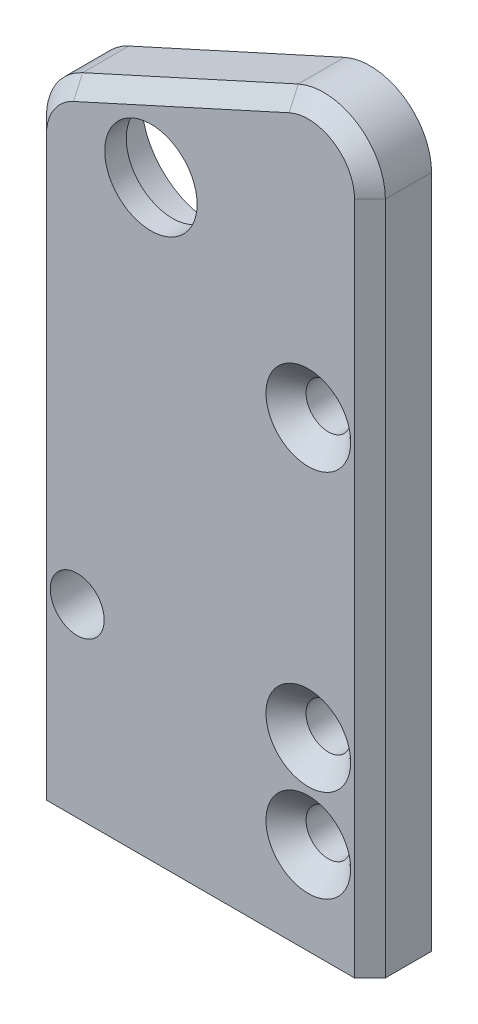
ISO-10303-21;
HEADER;
FILE_DESCRIPTION(('STEP AP214'),'2;1');
FILE_NAME('part.step','',(''),(''),'','','');
FILE_SCHEMA(('AUTOMOTIVE_DESIGN { 1 0 10303 214 1 1 1 1 }'));
ENDSEC;
DATA;
#1=APPLICATION_CONTEXT('core data for automotive mechanical design processes');
#2=APPLICATION_PROTOCOL_DEFINITION('international standard','automotive_design',2000,#1);
#3=PRODUCT_CONTEXT('',#1,'mechanical');
#4=PRODUCT('Part','Part','',(#3));
#5=PRODUCT_RELATED_PRODUCT_CATEGORY('part','',(#4));
#6=PRODUCT_DEFINITION_FORMATION('','',#4);
#7=PRODUCT_DEFINITION_CONTEXT('part definition',#1,'design');
#8=PRODUCT_DEFINITION('design','',#6,#7);
#9=PRODUCT_DEFINITION_SHAPE('','',#8);
#10=(LENGTH_UNIT() NAMED_UNIT(*) SI_UNIT(.MILLI.,.METRE.));
#11=(NAMED_UNIT(*) PLANE_ANGLE_UNIT() SI_UNIT($,.RADIAN.));
#12=(NAMED_UNIT(*) SI_UNIT($,.STERADIAN.) SOLID_ANGLE_UNIT());
#13=UNCERTAINTY_MEASURE_WITH_UNIT(LENGTH_MEASURE(1.E-05),#10,'distance_accuracy_value','');
#14=(GEOMETRIC_REPRESENTATION_CONTEXT(3) GLOBAL_UNCERTAINTY_ASSIGNED_CONTEXT((#13)) GLOBAL_UNIT_ASSIGNED_CONTEXT((#10,
#11,#12)) REPRESENTATION_CONTEXT('',''));
#15=CARTESIAN_POINT('',(0.,0.,0.));
#16=DIRECTION('',(0.,0.,1.));
#17=DIRECTION('',(1.,0.,0.));
#18=AXIS2_PLACEMENT_3D('',#15,#16,#17);
#19=CARTESIAN_POINT('',(7.78086952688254,38.3937133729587,4.));
#20=DIRECTION('',(0.,0.,1.));
#21=DIRECTION('',(1.,0.,0.));
#22=AXIS2_PLACEMENT_3D('',#19,#20,#21);
#23=CYLINDRICAL_SURFACE('',#22,3.);
#24=CARTESIAN_POINT('',(7.78086952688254,38.3937133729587,4.));
#25=DIRECTION('',(0.,0.,1.));
#26=DIRECTION('',(1.,0.,0.));
#27=AXIS2_PLACEMENT_3D('',#24,#25,#26);
#28=CIRCLE('',#27,3.);
#29=CARTESIAN_POINT('',(10.7808695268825,38.3937133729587,4.));
#30=VERTEX_POINT('',#29);
#31=EDGE_CURVE('E156',#30,#30,#28,.T.);
#32=ORIENTED_EDGE('',*,*,#31,.T.);
#33=EDGE_LOOP('',(#32));
#34=FACE_BOUND('',#33,.T.);
#35=CARTESIAN_POINT('',(7.78086952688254,38.3937133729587,2.6));
#36=DIRECTION('',(0.,0.,-1.));
#37=DIRECTION('',(-1.,0.,0.));
#38=AXIS2_PLACEMENT_3D('',#35,#36,#37);
#39=CIRCLE('',#38,3.);
#40=CARTESIAN_POINT('',(4.78086952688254,38.3937133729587,2.6));
#41=VERTEX_POINT('',#40);
#42=EDGE_CURVE('E43',#41,#41,#39,.F.);
#43=ORIENTED_EDGE('',*,*,#42,.F.);
#44=EDGE_LOOP('',(#43));
#45=FACE_BOUND('',#44,.T.);
#46=ADVANCED_FACE('F38',(#34,#45),#23,.F.);
#47=CARTESIAN_POINT('',(0.,40.,4.));
#48=DIRECTION('',(1.,0.,0.));
#49=DIRECTION('',(0.,1.,0.));
#50=AXIS2_PLACEMENT_3D('',#47,#48,#49);
#51=PLANE('',#50);
#52=DIRECTION('',(0.,0.,-1.));
#53=VECTOR('',#52,1.);
#54=CARTESIAN_POINT('',(0.,0.,4.));
#55=LINE('',#54,#53);
#56=CARTESIAN_POINT('',(0.,0.,3.));
#57=VERTEX_POINT('',#56);
#58=CARTESIAN_POINT('',(0.,0.,0.));
#59=VERTEX_POINT('',#58);
#60=EDGE_CURVE('E178',#57,#59,#55,.T.);
#61=ORIENTED_EDGE('',*,*,#60,.F.);
#62=DIRECTION('',(0.,1.,0.));
#63=VECTOR('',#62,1.);
#64=CARTESIAN_POINT('',(0.,37.4243469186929,3.));
#65=LINE('',#64,#63);
#66=CARTESIAN_POINT('',(0.,37.4243469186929,3.));
#67=VERTEX_POINT('',#66);
#68=EDGE_CURVE('E11',#57,#67,#65,.T.);
#69=ORIENTED_EDGE('',*,*,#68,.T.);
#70=DIRECTION('',(0.,0.,-1.));
#71=VECTOR('',#70,1.);
#72=CARTESIAN_POINT('',(0.,37.4243469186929,4.));
#73=LINE('',#72,#71);
#74=CARTESIAN_POINT('',(0.,37.4243469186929,0.));
#75=VERTEX_POINT('',#74);
#76=EDGE_CURVE('E180',#67,#75,#73,.T.);
#77=ORIENTED_EDGE('',*,*,#76,.T.);
#78=DIRECTION('',(0.,-1.,0.));
#79=VECTOR('',#78,1.);
#80=CARTESIAN_POINT('',(0.,40.,0.));
#81=LINE('',#80,#79);
#82=EDGE_CURVE('E165',#75,#59,#81,.T.);
#83=ORIENTED_EDGE('',*,*,#82,.T.);
#84=EDGE_LOOP('',(#61,#69,#77,#83));
#85=FACE_BOUND('',#84,.T.);
#86=ADVANCED_FACE('F268',(#85),#51,.F.);
#87=CARTESIAN_POINT('',(0.,0.,4.));
#88=DIRECTION('',(0.,1.,0.));
#89=DIRECTION('',(0.,0.,1.));
#90=AXIS2_PLACEMENT_3D('',#87,#88,#89);
#91=PLANE('',#90);
#92=CARTESIAN_POINT('',(4.,0.,2.));
#93=DIRECTION('',(0.,-1.,0.));
#94=DIRECTION('',(0.,0.,-1.));
#95=AXIS2_PLACEMENT_3D('',#92,#93,#94);
#96=CIRCLE('',#95,0.799999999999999);
#97=CARTESIAN_POINT('',(4.,0.,1.2));
#98=VERTEX_POINT('',#97);
#99=EDGE_CURVE('E126',#98,#98,#96,.T.);
#100=ORIENTED_EDGE('',*,*,#99,.F.);
#101=EDGE_LOOP('',(#100));
#102=FACE_BOUND('',#101,.T.);
#103=CARTESIAN_POINT('',(12.,0.,2.));
#104=DIRECTION('',(0.,-1.,0.));
#105=DIRECTION('',(0.,0.,-1.));
#106=AXIS2_PLACEMENT_3D('',#103,#104,#105);
#107=CIRCLE('',#106,0.799999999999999);
#108=CARTESIAN_POINT('',(12.,0.,1.2));
#109=VERTEX_POINT('',#108);
#110=EDGE_CURVE('E125',#109,#109,#107,.T.);
#111=ORIENTED_EDGE('',*,*,#110,.F.);
#112=EDGE_LOOP('',(#111));
#113=FACE_BOUND('',#112,.T.);
#114=DIRECTION('',(0.,0.,-1.));
#115=VECTOR('',#114,1.);
#116=CARTESIAN_POINT('',(22.,0.,4.));
#117=LINE('',#116,#115);
#118=CARTESIAN_POINT('',(22.,0.,3.));
#119=VERTEX_POINT('',#118);
#120=CARTESIAN_POINT('',(22.,0.,0.));
#121=VERTEX_POINT('',#120);
#122=EDGE_CURVE('E163',#119,#121,#117,.T.);
#123=ORIENTED_EDGE('',*,*,#122,.F.);
#124=DIRECTION('',(-0.707106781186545,0.,0.70710678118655));
#125=VECTOR('',#124,1.);
#126=CARTESIAN_POINT('',(21.,0.,4.));
#127=LINE('',#126,#125);
#128=CARTESIAN_POINT('',(21.,0.,4.));
#129=VERTEX_POINT('',#128);
#130=EDGE_CURVE('E208',#119,#129,#127,.T.);
#131=ORIENTED_EDGE('',*,*,#130,.T.);
#132=DIRECTION('',(1.,0.,0.));
#133=VECTOR('',#132,1.);
#134=CARTESIAN_POINT('',(0.,0.,4.));
#135=LINE('',#134,#133);
#136=CARTESIAN_POINT('',(0.999999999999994,0.,4.));
#137=VERTEX_POINT('',#136);
#138=EDGE_CURVE('E160',#137,#129,#135,.T.);
#139=ORIENTED_EDGE('',*,*,#138,.F.);
#140=DIRECTION('',(-0.707106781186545,0.,-0.70710678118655));
#141=VECTOR('',#140,1.);
#142=CARTESIAN_POINT('',(0.999999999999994,0.,4.));
#143=LINE('',#142,#141);
#144=EDGE_CURVE('E206',#137,#57,#143,.T.);
#145=ORIENTED_EDGE('',*,*,#144,.T.);
#146=ORIENTED_EDGE('',*,*,#60,.T.);
#147=DIRECTION('',(1.,0.,0.));
#148=VECTOR('',#147,1.);
#149=CARTESIAN_POINT('',(0.,0.,0.));
#150=LINE('',#149,#148);
#151=EDGE_CURVE('E168',#59,#121,#150,.T.);
#152=ORIENTED_EDGE('',*,*,#151,.T.);
#153=EDGE_LOOP('',(#123,#131,#139,#145,#146,#152));
#154=FACE_BOUND('',#153,.T.);
#155=ADVANCED_FACE('F236',(#102,#113,#154),#91,.F.);
#156=CARTESIAN_POINT('',(22.,0.,4.));
#157=DIRECTION('',(-1.,0.,0.));
#158=DIRECTION('',(0.,0.,1.));
#159=AXIS2_PLACEMENT_3D('',#156,#157,#158);
#160=PLANE('',#159);
#161=DIRECTION('',(0.,0.,-1.));
#162=VECTOR('',#161,1.);
#163=CARTESIAN_POINT('',(22.,43.7879832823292,4.));
#164=LINE('',#163,#162);
#165=CARTESIAN_POINT('',(22.,43.7879832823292,0.));
#166=VERTEX_POINT('',#165);
#167=CARTESIAN_POINT('',(22.,43.7879832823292,3.));
#168=VERTEX_POINT('',#167);
#169=EDGE_CURVE('E190',#166,#168,#164,.F.);
#170=ORIENTED_EDGE('',*,*,#169,.T.);
#171=DIRECTION('',(0.,-1.,0.));
#172=VECTOR('',#171,1.);
#173=CARTESIAN_POINT('',(22.,0.,3.));
#174=LINE('',#173,#172);
#175=EDGE_CURVE('E204',#168,#119,#174,.T.);
#176=ORIENTED_EDGE('',*,*,#175,.T.);
#177=ORIENTED_EDGE('',*,*,#122,.T.);
#178=DIRECTION('',(0.,1.,0.));
#179=VECTOR('',#178,1.);
#180=CARTESIAN_POINT('',(22.,0.,0.));
#181=LINE('',#180,#179);
#182=EDGE_CURVE('E172',#121,#166,#181,.T.);
#183=ORIENTED_EDGE('',*,*,#182,.T.);
#184=EDGE_LOOP('',(#170,#176,#177,#183));
#185=FACE_BOUND('',#184,.T.);
#186=ADVANCED_FACE('F257',(#185),#160,.F.);
#187=CARTESIAN_POINT('',(22.,50.,4.));
#188=DIRECTION('',(0.413802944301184,-0.910366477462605,0.));
#189=DIRECTION('',(0.910366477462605,0.413802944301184,0.));
#190=AXIS2_PLACEMENT_3D('',#187,#188,#189);
#191=PLANE('',#190);
#192=DIRECTION('',(0.,0.,-1.));
#193=VECTOR('',#192,1.);
#194=CARTESIAN_POINT('',(2.34478822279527,41.0658128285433,4.));
#195=LINE('',#194,#193);
#196=CARTESIAN_POINT('',(2.34478822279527,41.0658128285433,0.));
#197=VERTEX_POINT('',#196);
#198=CARTESIAN_POINT('',(2.34478822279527,41.0658128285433,3.));
#199=VERTEX_POINT('',#198);
#200=EDGE_CURVE('E188',#197,#199,#195,.F.);
#201=ORIENTED_EDGE('',*,*,#200,.T.);
#202=DIRECTION('',(0.910366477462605,0.413802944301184,0.));
#203=VECTOR('',#202,1.);
#204=CARTESIAN_POINT('',(16.3447882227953,47.4294491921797,3.));
#205=LINE('',#204,#203);
#206=CARTESIAN_POINT('',(16.3447882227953,47.4294491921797,3.));
#207=VERTEX_POINT('',#206);
#208=EDGE_CURVE('E212',#199,#207,#205,.T.);
#209=ORIENTED_EDGE('',*,*,#208,.T.);
#210=DIRECTION('',(0.,0.,-1.));
#211=VECTOR('',#210,1.);
#212=CARTESIAN_POINT('',(16.3447882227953,47.4294491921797,4.));
#213=LINE('',#212,#211);
#214=CARTESIAN_POINT('',(16.3447882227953,47.4294491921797,0.));
#215=VERTEX_POINT('',#214);
#216=EDGE_CURVE('E186',#207,#215,#213,.T.);
#217=ORIENTED_EDGE('',*,*,#216,.T.);
#218=DIRECTION('',(-0.910366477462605,-0.413802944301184,0.));
#219=VECTOR('',#218,1.);
#220=CARTESIAN_POINT('',(22.,50.,0.));
#221=LINE('',#220,#219);
#222=EDGE_CURVE('E164',#215,#197,#221,.T.);
#223=ORIENTED_EDGE('',*,*,#222,.T.);
#224=EDGE_LOOP('',(#201,#209,#217,#223));
#225=FACE_BOUND('',#224,.T.);
#226=ADVANCED_FACE('F266',(#225),#191,.F.);
#227=CARTESIAN_POINT('',(0.,0.,4.));
#228=DIRECTION('',(0.,0.,1.));
#229=DIRECTION('',(1.,0.,0.));
#230=AXIS2_PLACEMENT_3D('',#227,#228,#229);
#231=PLANE('',#230);
#232=CARTESIAN_POINT('',(3.,12.,4.));
#233=DIRECTION('',(0.,0.,1.));
#234=DIRECTION('',(1.,0.,0.));
#235=AXIS2_PLACEMENT_3D('',#232,#233,#234);
#236=CIRCLE('',#235,1.75);
#237=CARTESIAN_POINT('',(4.75,12.,4.));
#238=VERTEX_POINT('',#237);
#239=EDGE_CURVE('E508',#238,#238,#236,.T.);
#240=ORIENTED_EDGE('',*,*,#239,.F.);
#241=EDGE_LOOP('',(#240));
#242=FACE_BOUND('',#241,.T.);
#243=CARTESIAN_POINT('',(18.,30.,4.));
#244=DIRECTION('',(0.,0.,1.));
#245=DIRECTION('',(1.,0.,0.));
#246=AXIS2_PLACEMENT_3D('',#243,#244,#245);
#247=CIRCLE('',#246,2.75);
#248=CARTESIAN_POINT('',(20.75,30.,4.));
#249=VERTEX_POINT('',#248);
#250=EDGE_CURVE('E475',#249,#249,#247,.T.);
#251=ORIENTED_EDGE('',*,*,#250,.F.);
#252=EDGE_LOOP('',(#251));
#253=FACE_BOUND('',#252,.T.);
#254=CARTESIAN_POINT('',(18.,6.,4.));
#255=DIRECTION('',(0.,0.,1.));
#256=DIRECTION('',(1.,0.,0.));
#257=AXIS2_PLACEMENT_3D('',#254,#255,#256);
#258=CIRCLE('',#257,2.75);
#259=CARTESIAN_POINT('',(20.75,6.,4.));
#260=VERTEX_POINT('',#259);
#261=EDGE_CURVE('E138',#260,#260,#258,.T.);
#262=ORIENTED_EDGE('',*,*,#261,.F.);
#263=EDGE_LOOP('',(#262));
#264=FACE_BOUND('',#263,.T.);
#265=CARTESIAN_POINT('',(18.,12.,4.));
#266=DIRECTION('',(0.,0.,1.));
#267=DIRECTION('',(1.,0.,0.));
#268=AXIS2_PLACEMENT_3D('',#265,#266,#267);
#269=CIRCLE('',#268,2.75);
#270=CARTESIAN_POINT('',(20.75,12.,4.));
#271=VERTEX_POINT('',#270);
#272=EDGE_CURVE('E147',#271,#271,#269,.T.);
#273=ORIENTED_EDGE('',*,*,#272,.F.);
#274=EDGE_LOOP('',(#273));
#275=FACE_BOUND('',#274,.T.);
#276=ORIENTED_EDGE('',*,*,#31,.F.);
#277=EDGE_LOOP('',(#276));
#278=FACE_BOUND('',#277,.T.);
#279=ORIENTED_EDGE('',*,*,#138,.T.);
#280=DIRECTION('',(0.,1.,0.));
#281=VECTOR('',#280,1.);
#282=CARTESIAN_POINT('',(21.,43.7879832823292,4.));
#283=LINE('',#282,#281);
#284=CARTESIAN_POINT('',(21.,43.7879832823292,4.));
#285=VERTEX_POINT('',#284);
#286=EDGE_CURVE('E201',#129,#285,#283,.T.);
#287=ORIENTED_EDGE('',*,*,#286,.T.);
#288=CARTESIAN_POINT('',(18.,43.7879832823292,4.));
#289=DIRECTION('',(0.,0.,1.));
#290=DIRECTION('',(1.,0.,0.));
#291=AXIS2_PLACEMENT_3D('',#288,#289,#290);
#292=CIRCLE('',#291,3.00000000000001);
#293=CARTESIAN_POINT('',(16.7585911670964,46.5190827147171,4.));
#294=VERTEX_POINT('',#293);
#295=EDGE_CURVE('E199',#285,#294,#292,.T.);
#296=ORIENTED_EDGE('',*,*,#295,.T.);
#297=DIRECTION('',(-0.910366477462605,-0.413802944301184,0.));
#298=VECTOR('',#297,1.);
#299=CARTESIAN_POINT('',(2.75859116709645,40.1554463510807,4.));
#300=LINE('',#299,#298);
#301=CARTESIAN_POINT('',(2.75859116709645,40.1554463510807,4.));
#302=VERTEX_POINT('',#301);
#303=EDGE_CURVE('E197',#294,#302,#300,.T.);
#304=ORIENTED_EDGE('',*,*,#303,.T.);
#305=CARTESIAN_POINT('',(4.,37.4243469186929,4.));
#306=DIRECTION('',(0.,0.,1.));
#307=DIRECTION('',(1.,0.,0.));
#308=AXIS2_PLACEMENT_3D('',#305,#306,#307);
#309=CIRCLE('',#308,3.00000000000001);
#310=CARTESIAN_POINT('',(0.999999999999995,37.4243469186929,4.));
#311=VERTEX_POINT('',#310);
#312=EDGE_CURVE('E195',#302,#311,#309,.T.);
#313=ORIENTED_EDGE('',*,*,#312,.T.);
#314=DIRECTION('',(0.,-1.,0.));
#315=VECTOR('',#314,1.);
#316=CARTESIAN_POINT('',(0.999999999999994,0.,4.));
#317=LINE('',#316,#315);
#318=EDGE_CURVE('E193',#311,#137,#317,.T.);
#319=ORIENTED_EDGE('',*,*,#318,.T.);
#320=EDGE_LOOP('',(#279,#287,#296,#304,#313,#319));
#321=FACE_BOUND('',#320,.T.);
#322=ADVANCED_FACE('F232',(#242,#253,#264,#275,#278,#321),#231,.T.);
#323=CARTESIAN_POINT('',(0.,0.,0.));
#324=DIRECTION('',(0.,0.,1.));
#325=DIRECTION('',(1.,0.,0.));
#326=AXIS2_PLACEMENT_3D('',#323,#324,#325);
#327=PLANE('',#326);
#328=CARTESIAN_POINT('',(3.,12.,0.));
#329=DIRECTION('',(0.,0.,1.));
#330=DIRECTION('',(1.,0.,0.));
#331=AXIS2_PLACEMENT_3D('',#328,#329,#330);
#332=CIRCLE('',#331,1.75);
#333=CARTESIAN_POINT('',(4.75,12.,0.));
#334=VERTEX_POINT('',#333);
#335=EDGE_CURVE('E485',#334,#334,#332,.T.);
#336=ORIENTED_EDGE('',*,*,#335,.T.);
#337=EDGE_LOOP('',(#336));
#338=FACE_BOUND('',#337,.T.);
#339=CARTESIAN_POINT('',(7.78086952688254,38.3937133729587,0.));
#340=DIRECTION('',(0.,0.,-1.));
#341=DIRECTION('',(-1.,0.,0.));
#342=AXIS2_PLACEMENT_3D('',#339,#340,#341);
#343=CIRCLE('',#342,4.6);
#344=CARTESIAN_POINT('',(3.18086952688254,38.3937133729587,0.));
#345=VERTEX_POINT('',#344);
#346=EDGE_CURVE('E481',#345,#345,#343,.T.);
#347=ORIENTED_EDGE('',*,*,#346,.F.);
#348=EDGE_LOOP('',(#347));
#349=FACE_BOUND('',#348,.T.);
#350=CARTESIAN_POINT('',(18.,30.,0.));
#351=DIRECTION('',(0.,0.,1.));
#352=DIRECTION('',(1.,0.,0.));
#353=AXIS2_PLACEMENT_3D('',#350,#351,#352);
#354=CIRCLE('',#353,1.45);
#355=CARTESIAN_POINT('',(19.45,30.,0.));
#356=VERTEX_POINT('',#355);
#357=EDGE_CURVE('E132',#356,#356,#354,.T.);
#358=ORIENTED_EDGE('',*,*,#357,.T.);
#359=EDGE_LOOP('',(#358));
#360=FACE_BOUND('',#359,.T.);
#361=CARTESIAN_POINT('',(18.,6.,0.));
#362=DIRECTION('',(0.,0.,1.));
#363=DIRECTION('',(1.,0.,0.));
#364=AXIS2_PLACEMENT_3D('',#361,#362,#363);
#365=CIRCLE('',#364,1.45);
#366=CARTESIAN_POINT('',(19.45,6.,0.));
#367=VERTEX_POINT('',#366);
#368=EDGE_CURVE('E144',#367,#367,#365,.T.);
#369=ORIENTED_EDGE('',*,*,#368,.T.);
#370=EDGE_LOOP('',(#369));
#371=FACE_BOUND('',#370,.T.);
#372=CARTESIAN_POINT('',(18.,12.,0.));
#373=DIRECTION('',(0.,0.,1.));
#374=DIRECTION('',(1.,0.,0.));
#375=AXIS2_PLACEMENT_3D('',#372,#373,#374);
#376=CIRCLE('',#375,1.45);
#377=CARTESIAN_POINT('',(19.45,12.,0.));
#378=VERTEX_POINT('',#377);
#379=EDGE_CURVE('E153',#378,#378,#376,.T.);
#380=ORIENTED_EDGE('',*,*,#379,.T.);
#381=EDGE_LOOP('',(#380));
#382=FACE_BOUND('',#381,.T.);
#383=ORIENTED_EDGE('',*,*,#82,.F.);
#384=CARTESIAN_POINT('',(4.,37.4243469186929,0.));
#385=DIRECTION('',(0.,0.,1.));
#386=DIRECTION('',(1.,0.,0.));
#387=AXIS2_PLACEMENT_3D('',#384,#385,#386);
#388=CIRCLE('',#387,4.);
#389=EDGE_CURVE('E184',#75,#197,#388,.F.);
#390=ORIENTED_EDGE('',*,*,#389,.T.);
#391=ORIENTED_EDGE('',*,*,#222,.F.);
#392=CARTESIAN_POINT('',(18.,43.7879832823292,0.));
#393=DIRECTION('',(0.,0.,1.));
#394=DIRECTION('',(1.,0.,0.));
#395=AXIS2_PLACEMENT_3D('',#392,#393,#394);
#396=CIRCLE('',#395,4.);
#397=EDGE_CURVE('E182',#215,#166,#396,.F.);
#398=ORIENTED_EDGE('',*,*,#397,.T.);
#399=ORIENTED_EDGE('',*,*,#182,.F.);
#400=ORIENTED_EDGE('',*,*,#151,.F.);
#401=EDGE_LOOP('',(#383,#390,#391,#398,#399,#400));
#402=FACE_BOUND('',#401,.T.);
#403=ADVANCED_FACE('F262',(#338,#349,#360,#371,#382,#402),#327,.F.);
#404=CARTESIAN_POINT('',(4.,37.4243469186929,4.));
#405=DIRECTION('',(0.,0.,-1.));
#406=DIRECTION('',(-1.,0.,0.));
#407=AXIS2_PLACEMENT_3D('',#404,#405,#406);
#408=CYLINDRICAL_SURFACE('',#407,4.);
#409=ORIENTED_EDGE('',*,*,#76,.F.);
#410=CARTESIAN_POINT('',(4.,37.4243469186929,3.));
#411=DIRECTION('',(0.,0.,1.));
#412=DIRECTION('',(1.,0.,0.));
#413=AXIS2_PLACEMENT_3D('',#410,#411,#412);
#414=CIRCLE('',#413,4.);
#415=EDGE_CURVE('E48',#67,#199,#414,.F.);
#416=ORIENTED_EDGE('',*,*,#415,.T.);
#417=ORIENTED_EDGE('',*,*,#200,.F.);
#418=ORIENTED_EDGE('',*,*,#389,.F.);
#419=EDGE_LOOP('',(#409,#416,#417,#418));
#420=FACE_BOUND('',#419,.T.);
#421=ADVANCED_FACE('F267',(#420),#408,.T.);
#422=CARTESIAN_POINT('',(18.,43.7879832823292,4.));
#423=DIRECTION('',(0.,0.,-1.));
#424=DIRECTION('',(-1.,0.,0.));
#425=AXIS2_PLACEMENT_3D('',#422,#423,#424);
#426=CYLINDRICAL_SURFACE('',#425,4.);
#427=ORIENTED_EDGE('',*,*,#216,.F.);
#428=CARTESIAN_POINT('',(18.,43.7879832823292,3.));
#429=DIRECTION('',(0.,0.,1.));
#430=DIRECTION('',(1.,0.,0.));
#431=AXIS2_PLACEMENT_3D('',#428,#429,#430);
#432=CIRCLE('',#431,4.);
#433=EDGE_CURVE('E210',#207,#168,#432,.F.);
#434=ORIENTED_EDGE('',*,*,#433,.T.);
#435=ORIENTED_EDGE('',*,*,#169,.F.);
#436=ORIENTED_EDGE('',*,*,#397,.F.);
#437=EDGE_LOOP('',(#427,#434,#435,#436));
#438=FACE_BOUND('',#437,.T.);
#439=ADVANCED_FACE('F254',(#438),#426,.T.);
#440=CARTESIAN_POINT('',(0.999999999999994,0.,4.));
#441=DIRECTION('',(-0.70710678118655,0.,0.707106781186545));
#442=DIRECTION('',(0.,1.,0.));
#443=AXIS2_PLACEMENT_3D('',#440,#441,#442);
#444=PLANE('',#443);
#445=ORIENTED_EDGE('',*,*,#144,.F.);
#446=ORIENTED_EDGE('',*,*,#318,.F.);
#447=DIRECTION('',(0.707106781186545,0.,0.70710678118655));
#448=VECTOR('',#447,1.);
#449=CARTESIAN_POINT('',(0.,37.4243469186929,3.));
#450=LINE('',#449,#448);
#451=EDGE_CURVE('E169',#67,#311,#450,.T.);
#452=ORIENTED_EDGE('',*,*,#451,.F.);
#453=ORIENTED_EDGE('',*,*,#68,.F.);
#454=EDGE_LOOP('',(#445,#446,#452,#453));
#455=FACE_BOUND('',#454,.T.);
#456=ADVANCED_FACE('F41',(#455),#444,.T.);
#457=CARTESIAN_POINT('',(4.,37.4243469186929,4.));
#458=DIRECTION('',(0.,0.,-1.));
#459=DIRECTION('',(-1.,0.,0.));
#460=AXIS2_PLACEMENT_3D('',#457,#458,#459);
#461=CONICAL_SURFACE('',#460,3.00000000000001,0.785398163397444);
#462=ORIENTED_EDGE('',*,*,#451,.T.);
#463=ORIENTED_EDGE('',*,*,#312,.F.);
#464=DIRECTION('',(0.292602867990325,-0.643726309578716,0.70710678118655));
#465=VECTOR('',#464,1.);
#466=CARTESIAN_POINT('',(2.34478822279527,41.0658128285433,3.));
#467=LINE('',#466,#465);
#468=EDGE_CURVE('E219',#199,#302,#467,.T.);
#469=ORIENTED_EDGE('',*,*,#468,.F.);
#470=ORIENTED_EDGE('',*,*,#415,.F.);
#471=EDGE_LOOP('',(#462,#463,#469,#470));
#472=FACE_BOUND('',#471,.T.);
#473=ADVANCED_FACE('F225',(#472),#461,.T.);
#474=CARTESIAN_POINT('',(-14.6546902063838,32.2403184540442,4.));
#475=DIRECTION('',(-0.292602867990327,0.643726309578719,0.707106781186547));
#476=DIRECTION('',(0.910366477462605,0.413802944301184,0.));
#477=AXIS2_PLACEMENT_3D('',#474,#475,#476);
#478=PLANE('',#477);
#479=ORIENTED_EDGE('',*,*,#468,.T.);
#480=ORIENTED_EDGE('',*,*,#303,.F.);
#481=DIRECTION('',(0.292602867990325,-0.643726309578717,0.70710678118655));
#482=VECTOR('',#481,1.);
#483=CARTESIAN_POINT('',(16.3447882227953,47.4294491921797,3.));
#484=LINE('',#483,#482);
#485=EDGE_CURVE('E216',#207,#294,#484,.T.);
#486=ORIENTED_EDGE('',*,*,#485,.F.);
#487=ORIENTED_EDGE('',*,*,#208,.F.);
#488=EDGE_LOOP('',(#479,#480,#486,#487));
#489=FACE_BOUND('',#488,.T.);
#490=ADVANCED_FACE('F247',(#489),#478,.T.);
#491=CARTESIAN_POINT('',(18.,43.7879832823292,4.));
#492=DIRECTION('',(0.,0.,-1.));
#493=DIRECTION('',(-1.,0.,0.));
#494=AXIS2_PLACEMENT_3D('',#491,#492,#493);
#495=CONICAL_SURFACE('',#494,3.00000000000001,0.785398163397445);
#496=ORIENTED_EDGE('',*,*,#485,.T.);
#497=ORIENTED_EDGE('',*,*,#295,.F.);
#498=DIRECTION('',(-0.707106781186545,0.,0.70710678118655));
#499=VECTOR('',#498,1.);
#500=CARTESIAN_POINT('',(22.,43.7879832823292,3.));
#501=LINE('',#500,#499);
#502=EDGE_CURVE('E159',#168,#285,#501,.T.);
#503=ORIENTED_EDGE('',*,*,#502,.F.);
#504=ORIENTED_EDGE('',*,*,#433,.F.);
#505=EDGE_LOOP('',(#496,#497,#503,#504));
#506=FACE_BOUND('',#505,.T.);
#507=ADVANCED_FACE('F250',(#506),#495,.T.);
#508=CARTESIAN_POINT('',(21.,0.,4.));
#509=DIRECTION('',(0.70710678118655,0.,0.707106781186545));
#510=DIRECTION('',(0.,-1.,0.));
#511=AXIS2_PLACEMENT_3D('',#508,#509,#510);
#512=PLANE('',#511);
#513=ORIENTED_EDGE('',*,*,#130,.F.);
#514=ORIENTED_EDGE('',*,*,#175,.F.);
#515=ORIENTED_EDGE('',*,*,#502,.T.);
#516=ORIENTED_EDGE('',*,*,#286,.F.);
#517=EDGE_LOOP('',(#513,#514,#515,#516));
#518=FACE_BOUND('',#517,.T.);
#519=ADVANCED_FACE('F240',(#518),#512,.T.);
#520=CARTESIAN_POINT('',(18.,12.,4.));
#521=DIRECTION('',(0.,0.,1.));
#522=DIRECTION('',(1.,0.,0.));
#523=AXIS2_PLACEMENT_3D('',#520,#521,#522);
#524=CYLINDRICAL_SURFACE('',#523,1.44999999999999);
#525=ORIENTED_EDGE('',*,*,#379,.F.);
#526=EDGE_LOOP('',(#525));
#527=FACE_BOUND('',#526,.T.);
#528=CARTESIAN_POINT('',(18.,12.,2.69999999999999));
#529=DIRECTION('',(0.,0.,1.));
#530=DIRECTION('',(1.,0.,0.));
#531=AXIS2_PLACEMENT_3D('',#528,#529,#530);
#532=CIRCLE('',#531,1.44999999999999);
#533=CARTESIAN_POINT('',(19.45,12.,2.69999999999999));
#534=VERTEX_POINT('',#533);
#535=EDGE_CURVE('E150',#534,#534,#532,.T.);
#536=ORIENTED_EDGE('',*,*,#535,.T.);
#537=EDGE_LOOP('',(#536));
#538=FACE_BOUND('',#537,.T.);
#539=ADVANCED_FACE('F291',(#527,#538),#524,.F.);
#540=CARTESIAN_POINT('',(18.,12.,4.));
#541=DIRECTION('',(0.,0.,1.));
#542=DIRECTION('',(1.,0.,0.));
#543=AXIS2_PLACEMENT_3D('',#540,#541,#542);
#544=CONICAL_SURFACE('',#543,2.75,0.785398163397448);
#545=ORIENTED_EDGE('',*,*,#535,.F.);
#546=EDGE_LOOP('',(#545));
#547=FACE_BOUND('',#546,.T.);
#548=ORIENTED_EDGE('',*,*,#272,.T.);
#549=EDGE_LOOP('',(#548));
#550=FACE_BOUND('',#549,.T.);
#551=ADVANCED_FACE('F454',(#547,#550),#544,.F.);
#552=CARTESIAN_POINT('',(18.,6.,4.));
#553=DIRECTION('',(0.,0.,1.));
#554=DIRECTION('',(1.,0.,0.));
#555=AXIS2_PLACEMENT_3D('',#552,#553,#554);
#556=CYLINDRICAL_SURFACE('',#555,1.44999999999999);
#557=ORIENTED_EDGE('',*,*,#368,.F.);
#558=EDGE_LOOP('',(#557));
#559=FACE_BOUND('',#558,.T.);
#560=CARTESIAN_POINT('',(18.,6.,2.69999999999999));
#561=DIRECTION('',(0.,0.,1.));
#562=DIRECTION('',(1.,0.,0.));
#563=AXIS2_PLACEMENT_3D('',#560,#561,#562);
#564=CIRCLE('',#563,1.44999999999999);
#565=CARTESIAN_POINT('',(19.45,6.,2.69999999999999));
#566=VERTEX_POINT('',#565);
#567=EDGE_CURVE('E141',#566,#566,#564,.T.);
#568=ORIENTED_EDGE('',*,*,#567,.T.);
#569=EDGE_LOOP('',(#568));
#570=FACE_BOUND('',#569,.T.);
#571=ADVANCED_FACE('F450',(#559,#570),#556,.F.);
#572=CARTESIAN_POINT('',(18.,6.,4.));
#573=DIRECTION('',(0.,0.,1.));
#574=DIRECTION('',(1.,0.,0.));
#575=AXIS2_PLACEMENT_3D('',#572,#573,#574);
#576=CONICAL_SURFACE('',#575,2.75,0.785398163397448);
#577=ORIENTED_EDGE('',*,*,#567,.F.);
#578=EDGE_LOOP('',(#577));
#579=FACE_BOUND('',#578,.T.);
#580=ORIENTED_EDGE('',*,*,#261,.T.);
#581=EDGE_LOOP('',(#580));
#582=FACE_BOUND('',#581,.T.);
#583=ADVANCED_FACE('F355',(#579,#582),#576,.F.);
#584=CARTESIAN_POINT('',(12.,10.,2.));
#585=DIRECTION('',(0.,-1.,0.));
#586=DIRECTION('',(0.,0.,-1.));
#587=AXIS2_PLACEMENT_3D('',#584,#585,#586);
#588=CONICAL_SURFACE('',#587,0.799999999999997,1.02974425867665);
#589=CARTESIAN_POINT('',(12.,10.480688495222,2.));
#590=VERTEX_POINT('',#589);
#591=VERTEX_LOOP('',#590);
#592=FACE_BOUND('',#591,.T.);
#593=CARTESIAN_POINT('',(12.,10.,2.));
#594=DIRECTION('',(0.,-1.,0.));
#595=DIRECTION('',(0.,0.,-1.));
#596=AXIS2_PLACEMENT_3D('',#593,#594,#595);
#597=CIRCLE('',#596,0.799999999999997);
#598=CARTESIAN_POINT('',(12.,10.,1.2));
#599=VERTEX_POINT('',#598);
#600=EDGE_CURVE('E129',#599,#599,#597,.T.);
#601=ORIENTED_EDGE('',*,*,#600,.T.);
#602=EDGE_LOOP('',(#601));
#603=FACE_BOUND('',#602,.T.);
#604=ADVANCED_FACE('F360',(#592,#603),#588,.F.);
#605=CARTESIAN_POINT('',(12.,0.,2.));
#606=DIRECTION('',(0.,-1.,0.));
#607=DIRECTION('',(0.,0.,-1.));
#608=AXIS2_PLACEMENT_3D('',#605,#606,#607);
#609=CYLINDRICAL_SURFACE('',#608,0.799999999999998);
#610=ORIENTED_EDGE('',*,*,#600,.F.);
#611=EDGE_LOOP('',(#610));
#612=FACE_BOUND('',#611,.T.);
#613=ORIENTED_EDGE('',*,*,#110,.T.);
#614=EDGE_LOOP('',(#613));
#615=FACE_BOUND('',#614,.T.);
#616=ADVANCED_FACE('F119',(#612,#615),#609,.F.);
#617=CARTESIAN_POINT('',(4.,10.,2.));
#618=DIRECTION('',(0.,-1.,0.));
#619=DIRECTION('',(0.,0.,-1.));
#620=AXIS2_PLACEMENT_3D('',#617,#618,#619);
#621=CONICAL_SURFACE('',#620,0.799999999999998,1.02974425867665);
#622=CARTESIAN_POINT('',(3.99999999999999,10.480688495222,2.));
#623=VERTEX_POINT('',#622);
#624=VERTEX_LOOP('',#623);
#625=FACE_BOUND('',#624,.T.);
#626=CARTESIAN_POINT('',(4.,10.,2.));
#627=DIRECTION('',(0.,-1.,0.));
#628=DIRECTION('',(0.,0.,-1.));
#629=AXIS2_PLACEMENT_3D('',#626,#627,#628);
#630=CIRCLE('',#629,0.799999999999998);
#631=CARTESIAN_POINT('',(4.,10.,1.2));
#632=VERTEX_POINT('',#631);
#633=EDGE_CURVE('E123',#632,#632,#630,.T.);
#634=ORIENTED_EDGE('',*,*,#633,.T.);
#635=EDGE_LOOP('',(#634));
#636=FACE_BOUND('',#635,.T.);
#637=ADVANCED_FACE('F115',(#625,#636),#621,.F.);
#638=CARTESIAN_POINT('',(4.,0.,2.));
#639=DIRECTION('',(0.,-1.,0.));
#640=DIRECTION('',(0.,0.,-1.));
#641=AXIS2_PLACEMENT_3D('',#638,#639,#640);
#642=CYLINDRICAL_SURFACE('',#641,0.799999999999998);
#643=ORIENTED_EDGE('',*,*,#633,.F.);
#644=EDGE_LOOP('',(#643));
#645=FACE_BOUND('',#644,.T.);
#646=ORIENTED_EDGE('',*,*,#99,.T.);
#647=EDGE_LOOP('',(#646));
#648=FACE_BOUND('',#647,.T.);
#649=ADVANCED_FACE('F118',(#645,#648),#642,.F.);
#650=CARTESIAN_POINT('',(18.,30.,4.));
#651=DIRECTION('',(0.,0.,1.));
#652=DIRECTION('',(1.,0.,0.));
#653=AXIS2_PLACEMENT_3D('',#650,#651,#652);
#654=CYLINDRICAL_SURFACE('',#653,1.45);
#655=ORIENTED_EDGE('',*,*,#357,.F.);
#656=EDGE_LOOP('',(#655));
#657=FACE_BOUND('',#656,.T.);
#658=CARTESIAN_POINT('',(18.,30.,2.7));
#659=DIRECTION('',(0.,0.,1.));
#660=DIRECTION('',(1.,0.,0.));
#661=AXIS2_PLACEMENT_3D('',#658,#659,#660);
#662=CIRCLE('',#661,1.45);
#663=CARTESIAN_POINT('',(19.45,30.,2.7));
#664=VERTEX_POINT('',#663);
#665=EDGE_CURVE('E478',#664,#664,#662,.T.);
#666=ORIENTED_EDGE('',*,*,#665,.T.);
#667=EDGE_LOOP('',(#666));
#668=FACE_BOUND('',#667,.T.);
#669=ADVANCED_FACE('F389',(#657,#668),#654,.F.);
#670=CARTESIAN_POINT('',(18.,30.,4.));
#671=DIRECTION('',(0.,0.,1.));
#672=DIRECTION('',(1.,0.,0.));
#673=AXIS2_PLACEMENT_3D('',#670,#671,#672);
#674=CONICAL_SURFACE('',#673,2.75,0.785398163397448);
#675=ORIENTED_EDGE('',*,*,#665,.F.);
#676=EDGE_LOOP('',(#675));
#677=FACE_BOUND('',#676,.T.);
#678=ORIENTED_EDGE('',*,*,#250,.T.);
#679=EDGE_LOOP('',(#678));
#680=FACE_BOUND('',#679,.T.);
#681=ADVANCED_FACE('F398',(#677,#680),#674,.F.);
#682=CARTESIAN_POINT('',(7.78086952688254,38.3937133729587,2.6));
#683=DIRECTION('',(0.,0.,-1.));
#684=DIRECTION('',(-1.,0.,0.));
#685=AXIS2_PLACEMENT_3D('',#682,#683,#684);
#686=PLANE('',#685);
#687=CARTESIAN_POINT('',(7.78086952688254,38.3937133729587,2.6));
#688=DIRECTION('',(0.,0.,-1.));
#689=DIRECTION('',(-1.,0.,0.));
#690=AXIS2_PLACEMENT_3D('',#687,#688,#689);
#691=CIRCLE('',#690,4.6);
#692=CARTESIAN_POINT('',(3.18086952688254,38.3937133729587,2.6));
#693=VERTEX_POINT('',#692);
#694=EDGE_CURVE('E476',#693,#693,#691,.T.);
#695=ORIENTED_EDGE('',*,*,#694,.T.);
#696=EDGE_LOOP('',(#695));
#697=FACE_BOUND('',#696,.T.);
#698=ORIENTED_EDGE('',*,*,#42,.T.);
#699=EDGE_LOOP('',(#698));
#700=FACE_BOUND('',#699,.T.);
#701=ADVANCED_FACE('F408',(#697,#700),#686,.T.);
#702=CARTESIAN_POINT('',(7.78086952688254,38.3937133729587,2.6));
#703=DIRECTION('',(0.,0.,-1.));
#704=DIRECTION('',(-1.,0.,0.));
#705=AXIS2_PLACEMENT_3D('',#702,#703,#704);
#706=CYLINDRICAL_SURFACE('',#705,4.6);
#707=ORIENTED_EDGE('',*,*,#694,.F.);
#708=EDGE_LOOP('',(#707));
#709=FACE_BOUND('',#708,.T.);
#710=ORIENTED_EDGE('',*,*,#346,.T.);
#711=EDGE_LOOP('',(#710));
#712=FACE_BOUND('',#711,.T.);
#713=ADVANCED_FACE('F423',(#709,#712),#706,.F.);
#714=CARTESIAN_POINT('',(3.,12.,4.));
#715=DIRECTION('',(0.,0.,1.));
#716=DIRECTION('',(1.,0.,0.));
#717=AXIS2_PLACEMENT_3D('',#714,#715,#716);
#718=CYLINDRICAL_SURFACE('',#717,1.75);
#719=ORIENTED_EDGE('',*,*,#335,.F.);
#720=EDGE_LOOP('',(#719));
#721=FACE_BOUND('',#720,.T.);
#722=ORIENTED_EDGE('',*,*,#239,.T.);
#723=EDGE_LOOP('',(#722));
#724=FACE_BOUND('',#723,.T.);
#725=ADVANCED_FACE('F432',(#721,#724),#718,.F.);
#726=CLOSED_SHELL('',(#46,#86,#155,#186,#226,#322,#403,#421,#439,#456,#473,#490,#507,#519,#539,
#551,#571,#583,#604,#616,#637,#649,#669,#681,#701,#713,#725));
#727=MANIFOLD_SOLID_BREP('B2',#726);
#728=ADVANCED_BREP_SHAPE_REPRESENTATION('',(#18,#727),#14);
#729=SHAPE_DEFINITION_REPRESENTATION(#9,#728);
ENDSEC;
END-ISO-10303-21;
